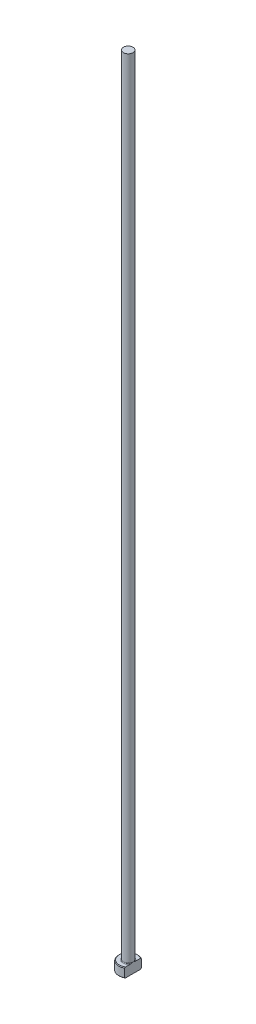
ISO-10303-21;
HEADER;
FILE_DESCRIPTION(('STEP AP214'),'2;1');
FILE_NAME('part.step','',(''),(''),'','','');
FILE_SCHEMA(('AUTOMOTIVE_DESIGN { 1 0 10303 214 1 1 1 1 }'));
ENDSEC;
DATA;
#1=APPLICATION_CONTEXT('core data for automotive mechanical design processes');
#2=APPLICATION_PROTOCOL_DEFINITION('international standard','automotive_design',2000,#1);
#3=PRODUCT_CONTEXT('',#1,'mechanical');
#4=PRODUCT('Part','Part','',(#3));
#5=PRODUCT_RELATED_PRODUCT_CATEGORY('part','',(#4));
#6=PRODUCT_DEFINITION_FORMATION('','',#4);
#7=PRODUCT_DEFINITION_CONTEXT('part definition',#1,'design');
#8=PRODUCT_DEFINITION('design','',#6,#7);
#9=PRODUCT_DEFINITION_SHAPE('','',#8);
#10=(LENGTH_UNIT() NAMED_UNIT(*) SI_UNIT(.MILLI.,.METRE.));
#11=(NAMED_UNIT(*) PLANE_ANGLE_UNIT() SI_UNIT($,.RADIAN.));
#12=(NAMED_UNIT(*) SI_UNIT($,.STERADIAN.) SOLID_ANGLE_UNIT());
#13=UNCERTAINTY_MEASURE_WITH_UNIT(LENGTH_MEASURE(1.E-05),#10,'distance_accuracy_value','');
#14=(GEOMETRIC_REPRESENTATION_CONTEXT(3) GLOBAL_UNCERTAINTY_ASSIGNED_CONTEXT((#13)) GLOBAL_UNIT_ASSIGNED_CONTEXT((#10,
#11,#12)) REPRESENTATION_CONTEXT('',''));
#15=CARTESIAN_POINT('',(0.,0.,0.));
#16=DIRECTION('',(0.,0.,1.));
#17=DIRECTION('',(1.,0.,0.));
#18=AXIS2_PLACEMENT_3D('',#15,#16,#17);
#19=CARTESIAN_POINT('',(0.,0.,0.));
#20=DIRECTION('',(0.,-1.,0.));
#21=DIRECTION('',(0.,0.,-1.));
#22=AXIS2_PLACEMENT_3D('',#19,#20,#21);
#23=PLANE('',#22);
#24=CARTESIAN_POINT('',(0.,0.,0.));
#25=DIRECTION('',(0.,-1.,0.));
#26=DIRECTION('',(0.,0.,-1.));
#27=AXIS2_PLACEMENT_3D('',#24,#25,#26);
#28=CIRCLE('',#27,2.8);
#29=CARTESIAN_POINT('',(1.49999999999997,0.,2.36431808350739));
#30=VERTEX_POINT('',#29);
#31=CARTESIAN_POINT('',(1.49999999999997,0.,-2.36431808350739));
#32=VERTEX_POINT('',#31);
#33=EDGE_CURVE('E98',#30,#32,#28,.T.);
#34=ORIENTED_EDGE('',*,*,#33,.T.);
#35=DIRECTION('',(0.,0.,1.));
#36=VECTOR('',#35,1.);
#37=CARTESIAN_POINT('',(1.49999999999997,0.,-2.5980762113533));
#38=LINE('',#37,#36);
#39=EDGE_CURVE('E83',#32,#30,#38,.T.);
#40=ORIENTED_EDGE('',*,*,#39,.T.);
#41=EDGE_LOOP('',(#34,#40));
#42=FACE_BOUND('',#41,.T.);
#43=ADVANCED_FACE('F32',(#42),#23,.T.);
#44=CARTESIAN_POINT('',(0.,259.958771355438,0.));
#45=DIRECTION('',(0.,1.,0.));
#46=DIRECTION('',(0.,0.,1.));
#47=AXIS2_PLACEMENT_3D('',#44,#45,#46);
#48=CYLINDRICAL_SURFACE('',#47,2.99999999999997);
#49=CARTESIAN_POINT('',(0.,2.80000000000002,0.));
#50=DIRECTION('',(0.,1.,0.));
#51=DIRECTION('',(0.,0.,1.));
#52=AXIS2_PLACEMENT_3D('',#49,#50,#51);
#53=CIRCLE('',#52,2.99999999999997);
#54=CARTESIAN_POINT('',(1.49999999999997,2.80000000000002,2.5980762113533));
#55=VERTEX_POINT('',#54);
#56=CARTESIAN_POINT('',(1.49999999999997,2.80000000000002,-2.5980762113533));
#57=VERTEX_POINT('',#56);
#58=EDGE_CURVE('E104',#55,#57,#53,.F.);
#59=ORIENTED_EDGE('',*,*,#58,.T.);
#60=DIRECTION('',(0.,-1.,0.));
#61=VECTOR('',#60,1.);
#62=CARTESIAN_POINT('',(1.49999999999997,250.,-2.5980762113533));
#63=LINE('',#62,#61);
#64=CARTESIAN_POINT('',(1.49999999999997,0.199999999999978,-2.5980762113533));
#65=VERTEX_POINT('',#64);
#66=EDGE_CURVE('E183',#57,#65,#63,.T.);
#67=ORIENTED_EDGE('',*,*,#66,.T.);
#68=CARTESIAN_POINT('',(0.,0.199999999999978,0.));
#69=DIRECTION('',(0.,-1.,0.));
#70=DIRECTION('',(0.,0.,-1.));
#71=AXIS2_PLACEMENT_3D('',#68,#69,#70);
#72=CIRCLE('',#71,2.99999999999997);
#73=CARTESIAN_POINT('',(1.49999999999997,0.199999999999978,2.5980762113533));
#74=VERTEX_POINT('',#73);
#75=EDGE_CURVE('E100',#65,#74,#72,.F.);
#76=ORIENTED_EDGE('',*,*,#75,.T.);
#77=DIRECTION('',(0.,-1.,0.));
#78=VECTOR('',#77,1.);
#79=CARTESIAN_POINT('',(1.49999999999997,250.,2.5980762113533));
#80=LINE('',#79,#78);
#81=EDGE_CURVE('E93',#55,#74,#80,.T.);
#82=ORIENTED_EDGE('',*,*,#81,.F.);
#83=EDGE_LOOP('',(#59,#67,#76,#82));
#84=FACE_BOUND('',#83,.T.);
#85=ADVANCED_FACE('F158',(#84),#48,.T.);
#86=CARTESIAN_POINT('',(-2.99999999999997,3.,0.));
#87=DIRECTION('',(0.,1.,0.));
#88=DIRECTION('',(0.,0.,1.));
#89=AXIS2_PLACEMENT_3D('',#86,#87,#88);
#90=PLANE('',#89);
#91=CARTESIAN_POINT('',(0.,3.,0.));
#92=DIRECTION('',(0.,1.,0.));
#93=DIRECTION('',(0.,0.,1.));
#94=AXIS2_PLACEMENT_3D('',#91,#92,#93);
#95=CIRCLE('',#94,2.80000000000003);
#96=CARTESIAN_POINT('',(1.49999999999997,3.,-2.36431808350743));
#97=VERTEX_POINT('',#96);
#98=CARTESIAN_POINT('',(1.49999999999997,3.,2.36431808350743));
#99=VERTEX_POINT('',#98);
#100=EDGE_CURVE('E178',#97,#99,#95,.T.);
#101=ORIENTED_EDGE('',*,*,#100,.T.);
#102=DIRECTION('',(0.,0.,-1.));
#103=VECTOR('',#102,1.);
#104=CARTESIAN_POINT('',(1.49999999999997,3.,0.));
#105=LINE('',#104,#103);
#106=CARTESIAN_POINT('',(1.49999999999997,2.99999999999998,0.799999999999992));
#107=VERTEX_POINT('',#106);
#108=EDGE_CURVE('E57',#99,#107,#105,.T.);
#109=ORIENTED_EDGE('',*,*,#108,.T.);
#110=CARTESIAN_POINT('',(0.,3.,0.));
#111=DIRECTION('',(0.,1.,0.));
#112=DIRECTION('',(0.,0.,1.));
#113=AXIS2_PLACEMENT_3D('',#110,#111,#112);
#114=CIRCLE('',#113,1.69999999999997);
#115=CARTESIAN_POINT('',(1.49999999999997,2.99999999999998,-0.799999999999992));
#116=VERTEX_POINT('',#115);
#117=EDGE_CURVE('E107',#107,#116,#114,.F.);
#118=ORIENTED_EDGE('',*,*,#117,.T.);
#119=EDGE_CURVE('E136',#116,#97,#105,.T.);
#120=ORIENTED_EDGE('',*,*,#119,.T.);
#121=EDGE_LOOP('',(#101,#109,#118,#120));
#122=FACE_BOUND('',#121,.T.);
#123=ADVANCED_FACE('F147',(#122),#90,.T.);
#124=CARTESIAN_POINT('',(0.,3.,0.));
#125=DIRECTION('',(0.,-1.,0.));
#126=DIRECTION('',(0.,0.,-1.));
#127=AXIS2_PLACEMENT_3D('',#124,#125,#126);
#128=CONICAL_SURFACE('',#127,2.80000000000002,0.785398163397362);
#129=ORIENTED_EDGE('',*,*,#58,.F.);
#130=CARTESIAN_POINT('',(1.49999999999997,-0.111741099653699,5.71827621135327));
#131=CARTESIAN_POINT('',(1.49999999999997,0.013618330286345,5.58866816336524));
#132=CARTESIAN_POINT('',(1.49999999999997,0.138843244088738,5.45892957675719));
#133=CARTESIAN_POINT('',(1.49999999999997,0.388944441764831,5.19911365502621));
#134=CARTESIAN_POINT('',(1.49999999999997,0.513820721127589,5.06903631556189));
#135=CARTESIAN_POINT('',(1.49999999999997,0.763205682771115,4.80840180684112));
#136=CARTESIAN_POINT('',(1.49999999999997,0.887714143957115,4.67784442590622));
#137=CARTESIAN_POINT('',(1.49999999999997,1.13618059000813,4.41620813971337));
#138=CARTESIAN_POINT('',(1.49999999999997,1.26013857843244,4.28512923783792));
#139=CARTESIAN_POINT('',(1.49999999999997,1.50488975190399,4.02490837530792));
#140=CARTESIAN_POINT('',(1.49999999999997,1.62569693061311,3.89577958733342));
#141=CARTESIAN_POINT('',(1.49999999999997,1.86640694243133,3.63668213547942));
#142=CARTESIAN_POINT('',(1.49999999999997,1.98630978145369,3.50671347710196));
#143=CARTESIAN_POINT('',(1.49999999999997,2.2248603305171,3.24567921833));
#144=CARTESIAN_POINT('',(1.49999999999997,2.34350830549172,3.11461386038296));
#145=CARTESIAN_POINT('',(1.49999999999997,2.57907716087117,2.85094268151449));
#146=CARTESIAN_POINT('',(1.49999999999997,2.69599811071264,2.71833692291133));
#147=CARTESIAN_POINT('',(1.49999999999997,2.88262371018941,2.50255231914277));
#148=CARTESIAN_POINT('',(1.49999999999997,2.95312454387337,2.42006293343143));
#149=CARTESIAN_POINT('',(1.49999999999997,3.0928709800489,2.25401084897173));
#150=CARTESIAN_POINT('',(1.49999999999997,3.16211645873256,2.17044804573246));
#151=CARTESIAN_POINT('',(1.49999999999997,3.29964684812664,2.00105967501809));
#152=CARTESIAN_POINT('',(1.49999999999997,3.36791386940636,1.91521952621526));
#153=CARTESIAN_POINT('',(1.49999999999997,3.50205840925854,1.74171392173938));
#154=CARTESIAN_POINT('',(1.49999999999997,3.56793649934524,1.65404891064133));
#155=CARTESIAN_POINT('',(1.49999999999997,3.69728151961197,1.47490236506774));
#156=CARTESIAN_POINT('',(1.49999999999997,3.76069661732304,1.3833830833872));
#157=CARTESIAN_POINT('',(1.49999999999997,3.88239539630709,1.19675661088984));
#158=CARTESIAN_POINT('',(1.49999999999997,3.94067201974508,1.10164473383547));
#159=CARTESIAN_POINT('',(1.49999999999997,4.04841325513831,0.908008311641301));
#160=CARTESIAN_POINT('',(1.49999999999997,4.09797809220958,0.809540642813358));
#161=CARTESIAN_POINT('',(1.49999999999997,4.18432188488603,0.607192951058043));
#162=CARTESIAN_POINT('',(1.49999999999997,4.22114374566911,0.50333247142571));
#163=CARTESIAN_POINT('',(1.49999999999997,4.26099935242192,0.347577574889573));
#164=CARTESIAN_POINT('',(1.49999999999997,4.27157029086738,0.297609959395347));
#165=CARTESIAN_POINT('',(1.49999999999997,4.28794860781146,0.196885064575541));
#166=CARTESIAN_POINT('',(1.49999999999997,4.29375640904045,0.1461278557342));
#167=CARTESIAN_POINT('',(1.49999999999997,4.30019707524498,0.0444388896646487));
#168=CARTESIAN_POINT('',(1.49999999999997,4.30084594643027,-0.0064918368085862));
#169=CARTESIAN_POINT('',(1.49999999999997,4.29696416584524,-0.108155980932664));
#170=CARTESIAN_POINT('',(1.49999999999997,4.29243308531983,-0.158889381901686));
#171=CARTESIAN_POINT('',(1.49999999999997,4.27856915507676,-0.259234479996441));
#172=CARTESIAN_POINT('',(1.49999999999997,4.26927821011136,-0.308852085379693));
#173=CARTESIAN_POINT('',(1.49999999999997,4.24647108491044,-0.407110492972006));
#174=CARTESIAN_POINT('',(1.49999999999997,4.23295324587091,-0.455750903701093));
#175=CARTESIAN_POINT('',(1.49999999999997,4.20226175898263,-0.552149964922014));
#176=CARTESIAN_POINT('',(1.49999999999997,4.18506801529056,-0.599902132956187));
#177=CARTESIAN_POINT('',(1.49999999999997,4.14771387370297,-0.694205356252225));
#178=CARTESIAN_POINT('',(1.49999999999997,4.12755408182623,-0.74075665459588));
#179=CARTESIAN_POINT('',(1.49999999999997,4.06327696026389,-0.879166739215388));
#180=CARTESIAN_POINT('',(1.49999999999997,4.01551721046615,-0.969329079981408));
#181=CARTESIAN_POINT('',(1.49999999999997,3.91367909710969,-1.14604316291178));
#182=CARTESIAN_POINT('',(1.49999999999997,3.85959300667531,-1.23259031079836));
#183=CARTESIAN_POINT('',(1.49999999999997,3.74697968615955,-1.40321348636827));
#184=CARTESIAN_POINT('',(1.49999999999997,3.68843573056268,-1.48727838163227));
#185=CARTESIAN_POINT('',(1.49999999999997,3.56843845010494,-1.65322187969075));
#186=CARTESIAN_POINT('',(1.49999999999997,3.50698656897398,-1.73510153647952));
#187=CARTESIAN_POINT('',(1.49999999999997,3.3811567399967,-1.89829823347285));
#188=CARTESIAN_POINT('',(1.49999999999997,3.31675092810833,-1.97959369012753));
#189=CARTESIAN_POINT('',(1.49999999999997,3.18634068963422,-2.14090082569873));
#190=CARTESIAN_POINT('',(1.49999999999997,3.12033609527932,-2.22091236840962));
#191=CARTESIAN_POINT('',(1.49999999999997,2.92086431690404,-2.4590650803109));
#192=CARTESIAN_POINT('',(1.49999999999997,2.78562663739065,-2.61572090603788));
#193=CARTESIAN_POINT('',(1.49999999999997,2.53554498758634,-2.90006295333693));
#194=CARTESIAN_POINT('',(1.49999999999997,2.42114543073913,-3.0281438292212));
#195=CARTESIAN_POINT('',(1.49999999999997,2.19093557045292,-3.28303767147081));
#196=CARTESIAN_POINT('',(1.49999999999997,2.07512522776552,-3.40985060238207));
#197=CARTESIAN_POINT('',(1.49999999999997,1.72597067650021,-3.7891384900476));
#198=CARTESIAN_POINT('',(1.49999999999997,1.49111760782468,-4.04022177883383));
#199=CARTESIAN_POINT('',(1.49999999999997,1.02882478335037,-4.52992803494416));
#200=CARTESIAN_POINT('',(1.49999999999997,0.801477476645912,-4.76863870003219));
#201=CARTESIAN_POINT('',(1.49999999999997,0.459548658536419,-5.12558036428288));
#202=CARTESIAN_POINT('',(1.49999999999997,0.345484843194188,-5.24430773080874));
#203=CARTESIAN_POINT('',(1.49999999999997,0.117071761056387,-5.48148573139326));
#204=CARTESIAN_POINT('',(1.49999999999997,0.00272249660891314,-5.59993636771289));
#205=CARTESIAN_POINT('',(1.49999999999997,-0.111741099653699,-5.71827621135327));
#206=B_SPLINE_CURVE_WITH_KNOTS('',3,(#130,#131,#132,#133,#134,#135,#136,#137,#138,#139,#140,
#141,#142,#143,#144,#145,#146,#147,#148,#149,#150,#151,#152,#153,#154,#155,#156,#157,#158,#159,
#160,#161,#162,#163,#164,#165,#166,#167,#168,#169,#170,#171,#172,#173,#174,#175,#176,#177,#178,
#179,#180,#181,#182,#183,#184,#185,#186,#187,#188,#189,#190,#191,#192,#193,#194,#195,#196,#197,
#198,#199,#200,#201,#202,#203,#204,#205),.UNSPECIFIED.,.F.,.F.,(4,2,2,2,2,2,2,2,2,2,2,2,2,2,2,2,
2,2,2,2,2,2,2,2,2,2,2,2,2,2,2,2,2,2,2,2,2,4),(0.,0.540943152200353,1.08189327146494,
1.62312052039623,2.16434426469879,2.69482920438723,3.22531067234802,3.75567781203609,
4.28602356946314,4.61155053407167,4.93710943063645,5.26610945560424,5.59503024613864,
5.92894782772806,6.26331713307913,6.59354403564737,6.92264800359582,7.07567478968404,
7.22868799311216,7.38122626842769,7.53377717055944,7.68500755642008,7.83629736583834,
7.98843643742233,8.14054446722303,8.44618799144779,8.75220879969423,9.05944044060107,
9.3665211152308,9.67764287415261,9.98879742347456,10.6095925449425,11.1247803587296,
11.6399825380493,12.6713544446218,13.6603005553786,14.1542238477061,14.6481430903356),.UNSPECIFIED.);
#207=EDGE_CURVE('E135',#55,#99,#206,.T.);
#208=ORIENTED_EDGE('',*,*,#207,.T.);
#209=ORIENTED_EDGE('',*,*,#100,.F.);
#210=EDGE_CURVE('E127',#97,#57,#206,.T.);
#211=ORIENTED_EDGE('',*,*,#210,.T.);
#212=EDGE_LOOP('',(#129,#208,#209,#211));
#213=FACE_BOUND('',#212,.T.);
#214=ADVANCED_FACE('F143',(#213),#128,.T.);
#215=CARTESIAN_POINT('',(0.,0.199999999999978,0.));
#216=DIRECTION('',(0.,1.,0.));
#217=DIRECTION('',(0.,0.,1.));
#218=AXIS2_PLACEMENT_3D('',#215,#216,#217);
#219=CONICAL_SURFACE('',#218,2.99999999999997,0.785398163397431);
#220=ORIENTED_EDGE('',*,*,#75,.F.);
#221=CARTESIAN_POINT('',(1.49999999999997,3.1117410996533,-5.71827621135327));
#222=CARTESIAN_POINT('',(1.49999999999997,2.98638166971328,-5.58866816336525));
#223=CARTESIAN_POINT('',(1.49999999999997,2.86115675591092,-5.45892957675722));
#224=CARTESIAN_POINT('',(1.49999999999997,2.61105555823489,-5.19911365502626));
#225=CARTESIAN_POINT('',(1.49999999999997,2.48617927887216,-5.06903631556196));
#226=CARTESIAN_POINT('',(1.49999999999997,2.23679431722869,-4.80840180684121));
#227=CARTESIAN_POINT('',(1.49999999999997,2.11228585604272,-4.67784442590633));
#228=CARTESIAN_POINT('',(1.49999999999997,1.86381940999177,-4.4162081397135));
#229=CARTESIAN_POINT('',(1.49999999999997,1.73986142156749,-4.28512923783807));
#230=CARTESIAN_POINT('',(1.49999999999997,1.49511024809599,-4.02490837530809));
#231=CARTESIAN_POINT('',(1.49999999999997,1.3743030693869,-3.8957795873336));
#232=CARTESIAN_POINT('',(1.49999999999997,1.13359305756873,-3.63668213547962));
#233=CARTESIAN_POINT('',(1.49999999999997,1.0136902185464,-3.50671347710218));
#234=CARTESIAN_POINT('',(1.49999999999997,0.775139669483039,-3.24567921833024));
#235=CARTESIAN_POINT('',(1.49999999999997,0.656491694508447,-3.11461386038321));
#236=CARTESIAN_POINT('',(1.49999999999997,0.420922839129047,-2.85094268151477));
#237=CARTESIAN_POINT('',(1.49999999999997,0.304001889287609,-2.71833692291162));
#238=CARTESIAN_POINT('',(1.49999999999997,0.117376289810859,-2.50255231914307));
#239=CARTESIAN_POINT('',(1.49999999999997,0.0468754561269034,-2.42006293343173));
#240=CARTESIAN_POINT('',(1.49999999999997,-0.0928709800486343,-2.254010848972));
#241=CARTESIAN_POINT('',(1.49999999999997,-0.162116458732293,-2.17044804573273));
#242=CARTESIAN_POINT('',(1.49999999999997,-0.299646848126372,-2.00105967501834));
#243=CARTESIAN_POINT('',(1.49999999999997,-0.367913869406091,-1.9152195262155));
#244=CARTESIAN_POINT('',(1.49999999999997,-0.502058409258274,-1.7417139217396));
#245=CARTESIAN_POINT('',(1.49999999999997,-0.567936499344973,-1.65404891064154));
#246=CARTESIAN_POINT('',(1.49999999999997,-0.697281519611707,-1.47490236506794));
#247=CARTESIAN_POINT('',(1.49999999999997,-0.760696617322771,-1.38338308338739));
#248=CARTESIAN_POINT('',(1.49999999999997,-0.882395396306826,-1.19675661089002));
#249=CARTESIAN_POINT('',(1.49999999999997,-0.940672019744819,-1.10164473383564));
#250=CARTESIAN_POINT('',(1.49999999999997,-1.04841325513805,-0.908008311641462));
#251=CARTESIAN_POINT('',(1.49999999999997,-1.09797809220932,-0.809540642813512));
#252=CARTESIAN_POINT('',(1.49999999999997,-1.18432188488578,-0.607192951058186));
#253=CARTESIAN_POINT('',(1.49999999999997,-1.22114374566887,-0.503332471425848));
#254=CARTESIAN_POINT('',(1.49999999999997,-1.26099935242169,-0.347577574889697));
#255=CARTESIAN_POINT('',(1.49999999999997,-1.27157029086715,-0.297609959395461));
#256=CARTESIAN_POINT('',(1.49999999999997,-1.28794860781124,-0.196885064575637));
#257=CARTESIAN_POINT('',(1.49999999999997,-1.29375640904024,-0.146127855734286));
#258=CARTESIAN_POINT('',(1.49999999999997,-1.30019707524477,-0.0444388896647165));
#259=CARTESIAN_POINT('',(1.49999999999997,-1.30084594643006,0.00649183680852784));
#260=CARTESIAN_POINT('',(1.49999999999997,-1.29696416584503,0.108155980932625));
#261=CARTESIAN_POINT('',(1.49999999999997,-1.29243308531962,0.158889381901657));
#262=CARTESIAN_POINT('',(1.49999999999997,-1.27856915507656,0.259234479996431));
#263=CARTESIAN_POINT('',(1.49999999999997,-1.26927821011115,0.308852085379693));
#264=CARTESIAN_POINT('',(1.49999999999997,-1.24647108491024,0.407110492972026));
#265=CARTESIAN_POINT('',(1.49999999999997,-1.2329532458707,0.455750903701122));
#266=CARTESIAN_POINT('',(1.49999999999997,-1.20226175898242,0.552149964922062));
#267=CARTESIAN_POINT('',(1.49999999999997,-1.18506801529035,0.599902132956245));
#268=CARTESIAN_POINT('',(1.49999999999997,-1.14771387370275,0.694205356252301));
#269=CARTESIAN_POINT('',(1.49999999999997,-1.12755408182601,0.740756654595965));
#270=CARTESIAN_POINT('',(1.49999999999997,-1.06327696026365,0.879166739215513));
#271=CARTESIAN_POINT('',(1.49999999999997,-1.0155172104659,0.969329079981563));
#272=CARTESIAN_POINT('',(1.49999999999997,-0.913679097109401,1.14604316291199));
#273=CARTESIAN_POINT('',(1.49999999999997,-0.859593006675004,1.2325903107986));
#274=CARTESIAN_POINT('',(1.49999999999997,-0.746979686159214,1.40321348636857));
#275=CARTESIAN_POINT('',(1.49999999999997,-0.688435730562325,1.4872783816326));
#276=CARTESIAN_POINT('',(1.49999999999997,-0.568438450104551,1.65322187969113));
#277=CARTESIAN_POINT('',(1.49999999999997,-0.506986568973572,1.73510153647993));
#278=CARTESIAN_POINT('',(1.49999999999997,-0.381156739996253,1.89829823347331));
#279=CARTESIAN_POINT('',(1.49999999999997,-0.31675092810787,1.97959369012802));
#280=CARTESIAN_POINT('',(1.49999999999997,-0.186340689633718,2.14090082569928));
#281=CARTESIAN_POINT('',(1.49999999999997,-0.120336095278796,2.22091236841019));
#282=CARTESIAN_POINT('',(1.49999999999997,0.0791356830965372,2.45906508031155));
#283=CARTESIAN_POINT('',(1.49999999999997,0.214373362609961,2.61572090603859));
#284=CARTESIAN_POINT('',(1.49999999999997,0.464455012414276,2.90006295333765));
#285=CARTESIAN_POINT('',(1.49999999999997,0.578854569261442,3.02814382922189));
#286=CARTESIAN_POINT('',(1.49999999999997,0.809064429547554,3.28303767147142));
#287=CARTESIAN_POINT('',(1.49999999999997,0.924874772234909,3.40985060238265));
#288=CARTESIAN_POINT('',(1.49999999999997,1.27402932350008,3.78913849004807));
#289=CARTESIAN_POINT('',(1.49999999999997,1.50888239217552,4.04022177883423));
#290=CARTESIAN_POINT('',(1.49999999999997,1.97117521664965,4.52992803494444));
#291=CARTESIAN_POINT('',(1.49999999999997,2.19852252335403,4.76863870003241));
#292=CARTESIAN_POINT('',(1.49999999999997,2.54045134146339,5.12558036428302));
#293=CARTESIAN_POINT('',(1.49999999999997,2.65451515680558,5.24430773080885));
#294=CARTESIAN_POINT('',(1.49999999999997,2.8829282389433,5.48148573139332));
#295=CARTESIAN_POINT('',(1.49999999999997,2.99727750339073,5.59993636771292));
#296=CARTESIAN_POINT('',(1.49999999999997,3.1117410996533,5.71827621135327));
#297=B_SPLINE_CURVE_WITH_KNOTS('',3,(#221,#222,#223,#224,#225,#226,#227,#228,#229,#230,#231,
#232,#233,#234,#235,#236,#237,#238,#239,#240,#241,#242,#243,#244,#245,#246,#247,#248,#249,#250,
#251,#252,#253,#254,#255,#256,#257,#258,#259,#260,#261,#262,#263,#264,#265,#266,#267,#268,#269,
#270,#271,#272,#273,#274,#275,#276,#277,#278,#279,#280,#281,#282,#283,#284,#285,#286,#287,#288,
#289,#290,#291,#292,#293,#294,#295,#296),.UNSPECIFIED.,.F.,.F.,(4,2,2,2,2,2,2,2,2,2,2,2,2,2,2,2,
2,2,2,2,2,2,2,2,2,2,2,2,2,2,2,2,2,2,2,2,2,4),(0.,0.540943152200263,1.08189327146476,
1.62312052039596,2.16434426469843,2.69482920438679,3.22531067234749,3.75567781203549,
4.28602356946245,4.611550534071,4.9371094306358,5.26610945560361,5.59503024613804,
5.92894782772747,6.26331713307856,6.59354403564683,6.92264800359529,7.07567478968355,
7.2286879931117,7.38122626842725,7.53377717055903,7.6850075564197,7.83629736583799,
7.98843643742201,8.14054446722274,8.4461879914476,8.75220879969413,9.05944044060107,
9.3665211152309,9.67764287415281,9.98879742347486,10.609592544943,11.1247803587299,
11.6399825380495,12.6713544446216,13.6603005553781,14.1542238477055,14.6481430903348),.UNSPECIFIED.);
#298=EDGE_CURVE('E86',#65,#32,#297,.T.);
#299=ORIENTED_EDGE('',*,*,#298,.T.);
#300=ORIENTED_EDGE('',*,*,#33,.F.);
#301=EDGE_CURVE('E89',#30,#74,#297,.T.);
#302=ORIENTED_EDGE('',*,*,#301,.T.);
#303=EDGE_LOOP('',(#220,#299,#300,#302));
#304=FACE_BOUND('',#303,.T.);
#305=ADVANCED_FACE('F97',(#304),#219,.T.);
#306=CARTESIAN_POINT('',(0.,3.19999999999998,0.));
#307=DIRECTION('',(0.,1.,0.));
#308=DIRECTION('',(0.,0.,1.));
#309=AXIS2_PLACEMENT_3D('',#306,#307,#308);
#310=TOROIDAL_SURFACE('',#309,1.69999999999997,0.2);
#311=CARTESIAN_POINT('',(1.49999999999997,3.19999999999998,0.));
#312=CARTESIAN_POINT('',(1.49999999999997,3.20000050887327,7.14686524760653E-11));
#313=CARTESIAN_POINT('',(1.49999999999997,3.20000101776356,-1.21663671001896E-07));
#314=CARTESIAN_POINT('',(1.49999999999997,3.20000199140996,-4.97616231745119E-07));
#315=CARTESIAN_POINT('',(1.49999999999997,3.20000245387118,-7.56516213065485E-07));
#316=CARTESIAN_POINT('',(1.49999999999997,3.20000338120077,-1.37642836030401E-06));
#317=CARTESIAN_POINT('',(1.49999999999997,3.20000384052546,-1.74563475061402E-06));
#318=CARTESIAN_POINT('',(1.49999999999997,3.20000469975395,-2.53565983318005E-06));
#319=CARTESIAN_POINT('',(1.49999999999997,3.20000510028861,-2.95582595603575E-06));
#320=CARTESIAN_POINT('',(1.49999999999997,3.20000646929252,-4.48430443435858E-06));
#321=CARTESIAN_POINT('',(1.49999999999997,3.20000736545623,-5.6586103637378E-06));
#322=CARTESIAN_POINT('',(1.49999999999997,3.20000893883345,-8.06479198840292E-06));
#323=CARTESIAN_POINT('',(1.49999999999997,3.20000962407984,-9.29170513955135E-06));
#324=CARTESIAN_POINT('',(1.49999999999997,3.2000122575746,-1.41623288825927E-05));
#325=CARTESIAN_POINT('',(1.49999999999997,3.20001407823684,-1.78790031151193E-05));
#326=CARTESIAN_POINT('',(1.49999999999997,3.20001699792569,-2.51443065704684E-05));
#327=CARTESIAN_POINT('',(1.49999999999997,3.20001815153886,-2.86715393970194E-05));
#328=CARTESIAN_POINT('',(1.49999999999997,3.20002315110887,-4.39218127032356E-05));
#329=CARTESIAN_POINT('',(1.49999999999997,3.2000270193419,-5.56288388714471E-05));
#330=CARTESIAN_POINT('',(1.49999999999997,3.20003312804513,-7.74058287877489E-05));
#331=CARTESIAN_POINT('',(1.49999999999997,3.20003553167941,-8.7427840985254E-05));
#332=CARTESIAN_POINT('',(1.49999999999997,3.20005483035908,-0.00016122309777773));
#333=CARTESIAN_POINT('',(1.49999999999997,3.2000797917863,-0.000222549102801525));
#334=CARTESIAN_POINT('',(1.49999999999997,3.20017391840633,-0.000462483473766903));
#335=CARTESIAN_POINT('',(1.49999999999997,3.20023706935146,-0.000642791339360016));
#336=CARTESIAN_POINT('',(1.49999999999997,3.20048761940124,-0.00134785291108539));
#337=CARTESIAN_POINT('',(1.49999999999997,3.20068132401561,-0.00187087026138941));
#338=CARTESIAN_POINT('',(1.49999999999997,3.20147357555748,-0.0040200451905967));
#339=CARTESIAN_POINT('',(1.49999999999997,3.20206499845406,-0.00564811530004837));
#340=CARTESIAN_POINT('',(1.49999999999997,3.2089263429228,-0.0245232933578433));
#341=CARTESIAN_POINT('',(1.49999999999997,3.21523683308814,-0.0417598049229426));
#342=CARTESIAN_POINT('',(1.49999999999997,3.22755028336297,-0.0756091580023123));
#343=CARTESIAN_POINT('',(1.49999999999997,3.23355589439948,-0.0922211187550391));
#344=CARTESIAN_POINT('',(1.49999999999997,3.2462010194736,-0.127454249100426));
#345=CARTESIAN_POINT('',(1.49999999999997,3.25283080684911,-0.146078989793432));
#346=CARTESIAN_POINT('',(1.49999999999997,3.26599765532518,-0.183577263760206));
#347=CARTESIAN_POINT('',(1.49999999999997,3.2725330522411,-0.202451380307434));
#348=CARTESIAN_POINT('',(1.49999999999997,3.28834228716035,-0.248982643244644));
#349=CARTESIAN_POINT('',(1.49999999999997,3.29749152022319,-0.276682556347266));
#350=CARTESIAN_POINT('',(1.49999999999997,3.3149093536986,-0.331625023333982));
#351=CARTESIAN_POINT('',(1.49999999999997,3.32319386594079,-0.358862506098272));
#352=CARTESIAN_POINT('',(1.49999999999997,3.34051594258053,-0.419125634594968));
#353=CARTESIAN_POINT('',(1.49999999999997,3.34936607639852,-0.452206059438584));
#354=CARTESIAN_POINT('',(1.49999999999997,3.36549583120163,-0.519023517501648));
#355=CARTESIAN_POINT('',(1.49999999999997,3.37276283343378,-0.552763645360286));
#356=CARTESIAN_POINT('',(1.49999999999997,3.38554755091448,-0.623053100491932));
#357=CARTESIAN_POINT('',(1.49999999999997,3.39090573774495,-0.659632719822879));
#358=CARTESIAN_POINT('',(1.49999999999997,3.39825016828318,-0.733028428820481));
#359=CARTESIAN_POINT('',(1.49999999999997,3.40024734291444,-0.769843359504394));
#360=CARTESIAN_POINT('',(1.49999999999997,3.39970780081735,-0.842856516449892));
#361=CARTESIAN_POINT('',(1.49999999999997,3.39725347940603,-0.87905368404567));
#362=CARTESIAN_POINT('',(1.49999999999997,3.38900085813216,-0.932380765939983));
#363=CARTESIAN_POINT('',(1.49999999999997,3.38553049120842,-0.949868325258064));
#364=CARTESIAN_POINT('',(1.49999999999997,3.37678336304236,-0.98437493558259));
#365=CARTESIAN_POINT('',(1.49999999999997,3.37150943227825,-1.00139467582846));
#366=CARTESIAN_POINT('',(1.49999999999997,3.35869781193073,-1.03479423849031));
#367=CARTESIAN_POINT('',(1.49999999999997,3.3511359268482,-1.05116499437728));
#368=CARTESIAN_POINT('',(1.49999999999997,3.33325333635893,-1.08234828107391));
#369=CARTESIAN_POINT('',(1.49999999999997,3.32294266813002,-1.097166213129));
#370=CARTESIAN_POINT('',(1.49999999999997,3.30512758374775,-1.11714173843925));
#371=CARTESIAN_POINT('',(1.49999999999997,3.29884721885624,-1.1233906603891));
#372=CARTESIAN_POINT('',(1.49999999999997,3.28545950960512,-1.13494695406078));
#373=CARTESIAN_POINT('',(1.49999999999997,3.27835226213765,-1.14025443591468));
#374=CARTESIAN_POINT('',(1.49999999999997,3.26325970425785,-1.14967631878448));
#375=CARTESIAN_POINT('',(1.49999999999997,3.25526534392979,-1.1537764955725));
#376=CARTESIAN_POINT('',(1.49999999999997,3.23863207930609,-1.16034952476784));
#377=CARTESIAN_POINT('',(1.49999999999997,3.22999427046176,-1.16282507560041));
#378=CARTESIAN_POINT('',(1.49999999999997,3.21343922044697,-1.16570267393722));
#379=CARTESIAN_POINT('',(1.49999999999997,3.20555896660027,-1.16631687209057));
#380=CARTESIAN_POINT('',(1.49999999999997,3.18982775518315,-1.16602054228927));
#381=CARTESIAN_POINT('',(1.49999999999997,3.18197679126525,-1.16511036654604));
#382=CARTESIAN_POINT('',(1.49999999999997,3.16747846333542,-1.16204446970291));
#383=CARTESIAN_POINT('',(1.49999999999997,3.16079696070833,-1.16004509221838));
#384=CARTESIAN_POINT('',(1.49999999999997,3.14781700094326,-1.15505972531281));
#385=CARTESIAN_POINT('',(1.49999999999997,3.14151862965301,-1.1520735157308));
#386=CARTESIAN_POINT('',(1.49999999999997,3.12690214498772,-1.14387585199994));
#387=CARTESIAN_POINT('',(1.49999999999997,3.11881436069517,-1.13825400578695));
#388=CARTESIAN_POINT('',(1.49999999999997,3.1036444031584,-1.12578441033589));
#389=CARTESIAN_POINT('',(1.49999999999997,3.09656475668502,-1.11893367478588));
#390=CARTESIAN_POINT('',(1.49999999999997,3.08012297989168,-1.10074342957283));
#391=CARTESIAN_POINT('',(1.49999999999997,3.07136543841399,-1.08886044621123));
#392=CARTESIAN_POINT('',(1.49999999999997,3.05578194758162,-1.06392743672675));
#393=CARTESIAN_POINT('',(1.49999999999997,3.0489571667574,-1.05087671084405));
#394=CARTESIAN_POINT('',(1.49999999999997,3.03273856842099,-1.0147230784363));
#395=CARTESIAN_POINT('',(1.49999999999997,3.02486230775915,-0.990945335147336));
#396=CARTESIAN_POINT('',(1.49999999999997,3.01257693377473,-0.942321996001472));
#397=CARTESIAN_POINT('',(1.49999999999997,3.00820590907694,-0.917467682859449));
#398=CARTESIAN_POINT('',(1.49999999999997,3.00229956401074,-0.867912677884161));
#399=CARTESIAN_POINT('',(1.49999999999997,3.0007128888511,-0.843217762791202));
#400=CARTESIAN_POINT('',(1.49999999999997,2.9996723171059,-0.793746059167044));
#401=CARTESIAN_POINT('',(1.49999999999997,3.0002230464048,-0.768969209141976));
#402=CARTESIAN_POINT('',(1.49999999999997,3.00433101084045,-0.696994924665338));
#403=CARTESIAN_POINT('',(1.49999999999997,3.01016976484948,-0.649931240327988));
#404=CARTESIAN_POINT('',(1.49999999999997,3.02567776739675,-0.559166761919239));
#405=CARTESIAN_POINT('',(1.49999999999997,3.03511950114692,-0.515423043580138));
#406=CARTESIAN_POINT('',(1.49999999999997,3.05693059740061,-0.427590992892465));
#407=CARTESIAN_POINT('',(1.49999999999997,3.0693635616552,-0.383518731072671));
#408=CARTESIAN_POINT('',(1.49999999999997,3.0917495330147,-0.310161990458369));
#409=CARTESIAN_POINT('',(1.49999999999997,3.1011984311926,-0.280718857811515));
#410=CARTESIAN_POINT('',(1.49999999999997,3.12060442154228,-0.22234098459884));
#411=CARTESIAN_POINT('',(1.49999999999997,3.13055519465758,-0.193404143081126));
#412=CARTESIAN_POINT('',(1.49999999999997,3.14973721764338,-0.1387568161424));
#413=CARTESIAN_POINT('',(1.49999999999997,3.15893123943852,-0.113033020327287));
#414=CARTESIAN_POINT('',(1.49999999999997,3.17788037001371,-0.0606351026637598));
#415=CARTESIAN_POINT('',(1.49999999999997,3.18764328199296,-0.0339636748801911));
#416=CARTESIAN_POINT('',(1.49999999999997,3.19793548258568,-0.00564657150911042));
#417=CARTESIAN_POINT('',(1.49999999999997,3.19852751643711,-0.00401699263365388));
#418=CARTESIAN_POINT('',(1.49999999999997,3.1993199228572,-0.00186745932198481));
#419=CARTESIAN_POINT('',(1.49999999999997,3.1995131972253,-0.00134559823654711));
#420=CARTESIAN_POINT('',(1.49999999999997,3.19976322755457,-0.000641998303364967));
#421=CARTESIAN_POINT('',(1.49999999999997,3.19982627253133,-0.000461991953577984));
#422=CARTESIAN_POINT('',(1.49999999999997,3.19992025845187,-0.000222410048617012));
#423=CARTESIAN_POINT('',(1.49999999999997,3.19994519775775,-0.000161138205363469));
#424=CARTESIAN_POINT('',(1.49999999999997,3.1999644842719,-8.74039265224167E-05));
#425=CARTESIAN_POINT('',(1.49999999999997,3.19996688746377,-7.73857554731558E-05));
#426=CARTESIAN_POINT('',(1.49999999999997,3.19997299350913,-5.56173270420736E-05));
#427=CARTESIAN_POINT('',(1.49999999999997,3.19997685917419,-4.39149185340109E-05));
#428=CARTESIAN_POINT('',(1.49999999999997,3.19998185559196,-2.86698156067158E-05));
#429=CARTESIAN_POINT('',(1.49999999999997,3.19998300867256,-2.51431574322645E-05));
#430=CARTESIAN_POINT('',(1.49999999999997,3.19998592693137,-1.78789551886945E-05));
#431=CARTESIAN_POINT('',(1.49999999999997,3.19998774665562,-1.41627846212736E-05));
#432=CARTESIAN_POINT('',(1.49999999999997,3.1999903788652,-9.29264485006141E-06));
#433=CARTESIAN_POINT('',(1.49999999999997,3.19999106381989,-8.06577596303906E-06));
#434=CARTESIAN_POINT('',(1.49999999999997,3.19999263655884,-5.65962636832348E-06));
#435=CARTESIAN_POINT('',(1.49999999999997,3.19999353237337,-4.48530463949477E-06));
#436=CARTESIAN_POINT('',(1.49999999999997,3.19999490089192,-2.95673739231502E-06));
#437=CARTESIAN_POINT('',(1.49999999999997,3.19999530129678,-2.53653206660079E-06));
#438=CARTESIAN_POINT('',(1.49999999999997,3.19999616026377,-1.74640524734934E-06));
#439=CARTESIAN_POINT('',(1.49999999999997,3.19999661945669,-1.37713597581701E-06));
#440=CARTESIAN_POINT('',(1.49999999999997,3.19999754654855,-7.57072329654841E-07));
#441=CARTESIAN_POINT('',(1.49999999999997,3.1999980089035,-4.98087382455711E-07));
#442=CARTESIAN_POINT('',(1.49999999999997,3.19999898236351,-1.21927247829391E-07));
#443=CARTESIAN_POINT('',(1.49999999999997,3.19999949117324,-7.14621145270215E-11));
#444=CARTESIAN_POINT('',(1.49999999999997,3.19999999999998,0.));
#445=B_SPLINE_CURVE_WITH_KNOTS('',3,(#311,#312,#313,#314,#315,#316,#317,#318,#319,#320,#321,
#322,#323,#324,#325,#326,#327,#328,#329,#330,#331,#332,#333,#334,#335,#336,#337,#338,#339,#340,
#341,#342,#343,#344,#345,#346,#347,#348,#349,#350,#351,#352,#353,#354,#355,#356,#357,#358,#359,
#360,#361,#362,#363,#364,#365,#366,#367,#368,#369,#370,#371,#372,#373,#374,#375,#376,#377,#378,
#379,#380,#381,#382,#383,#384,#385,#386,#387,#388,#389,#390,#391,#392,#393,#394,#395,#396,#397,
#398,#399,#400,#401,#402,#403,#404,#405,#406,#407,#408,#409,#410,#411,#412,#413,#414,#415,#416,
#417,#418,#419,#420,#421,#422,#423,#424,#425,#426,#427,#428,#429,#430,#431,#432,#433,#434,#435,
#436,#437,#438,#439,#440,#441,#442,#443,#444),.UNSPECIFIED.,.T.,.F.,(4,2,2,2,2,2,2,2,2,2,2,2,2,
2,2,2,2,2,2,2,2,2,2,2,2,2,2,2,2,2,2,2,2,2,2,2,2,2,2,2,2,2,2,2,2,2,2,2,2,2,2,2,2,2,2,2,2,2,2,2,2,
2,2,2,2,2,4),(0.,1.5268750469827E-06,3.1095939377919E-06,4.8697676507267E-06,
6.6094009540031E-06,1.1020252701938E-05,1.52327800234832E-05,2.76140373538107E-05,
3.87351647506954E-05,7.57188333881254E-05,0.000106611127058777,0.000304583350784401,
0.000878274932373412,0.00255078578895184,0.00774802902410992,0.0628090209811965,
0.115802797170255,0.175110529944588,0.235030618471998,0.322539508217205,0.407938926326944,
0.510638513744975,0.614128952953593,0.724918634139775,0.835347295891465,0.943752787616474,
0.997165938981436,1.05049564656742,1.10441029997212,1.1581307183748,1.18463966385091,
1.21114550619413,1.23795217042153,1.26471419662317,1.28828324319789,1.31184684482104,
1.33268332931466,1.35352446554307,1.38290826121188,1.41236445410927,1.45639976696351,
1.5004616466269,1.5751878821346,1.65071550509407,1.72483484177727,1.79911468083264,
1.94105061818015,2.07520625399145,2.21251544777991,2.30527614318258,2.3970705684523,
2.47902409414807,2.56422207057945,2.56942417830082,2.57109299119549,2.57166572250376,
2.57186352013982,2.57189440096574,2.57193136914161,2.5719424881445,2.5719548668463,
2.57195907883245,2.5719634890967,2.571965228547,2.57196698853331,2.5719685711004,
2.57197009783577),.UNSPECIFIED.);
#446=CARTESIAN_POINT('',(1.49999999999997,3.19999999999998,0.));
#447=VERTEX_POINT('',#446);
#448=EDGE_CURVE('E11',#116,#447,#445,.T.);
#449=ORIENTED_EDGE('',*,*,#448,.F.);
#450=ORIENTED_EDGE('',*,*,#117,.F.);
#451=CARTESIAN_POINT('',(1.49999999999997,3.19999999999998,0.));
#452=CARTESIAN_POINT('',(1.49999999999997,3.19999949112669,-7.14686931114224E-11));
#453=CARTESIAN_POINT('',(1.49999999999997,3.1999989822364,1.21663670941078E-07));
#454=CARTESIAN_POINT('',(1.49999999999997,3.19999800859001,4.97616231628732E-07));
#455=CARTESIAN_POINT('',(1.49999999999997,3.19999754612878,7.56516212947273E-07));
#456=CARTESIAN_POINT('',(1.49999999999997,3.19999661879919,1.37642836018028E-06));
#457=CARTESIAN_POINT('',(1.49999999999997,3.1999961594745,1.74563475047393E-06));
#458=CARTESIAN_POINT('',(1.49999999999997,3.19999530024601,2.53565983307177E-06));
#459=CARTESIAN_POINT('',(1.49999999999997,3.19999489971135,2.95582595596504E-06));
#460=CARTESIAN_POINT('',(1.49999999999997,3.19999353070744,4.48430443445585E-06));
#461=CARTESIAN_POINT('',(1.49999999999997,3.19999263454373,5.65861036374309E-06));
#462=CARTESIAN_POINT('',(1.49999999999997,3.19999106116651,8.06479198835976E-06));
#463=CARTESIAN_POINT('',(1.49999999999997,3.19999037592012,9.29170513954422E-06));
#464=CARTESIAN_POINT('',(1.49999999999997,3.19998774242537,1.41623288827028E-05));
#465=CARTESIAN_POINT('',(1.49999999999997,3.19998592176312,1.78790031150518E-05));
#466=CARTESIAN_POINT('',(1.49999999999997,3.19998300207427,2.51443065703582E-05));
#467=CARTESIAN_POINT('',(1.49999999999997,3.1999818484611,2.86715393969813E-05));
#468=CARTESIAN_POINT('',(1.49999999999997,3.19997684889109,4.39218127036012E-05));
#469=CARTESIAN_POINT('',(1.49999999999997,3.19997298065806,5.56288388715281E-05));
#470=CARTESIAN_POINT('',(1.49999999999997,3.19996687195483,7.7405828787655E-05));
#471=CARTESIAN_POINT('',(1.49999999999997,3.19996446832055,8.74278409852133E-05));
#472=CARTESIAN_POINT('',(1.49999999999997,3.19994516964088,0.000161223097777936));
#473=CARTESIAN_POINT('',(1.49999999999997,3.19992020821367,0.00022254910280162));
#474=CARTESIAN_POINT('',(1.49999999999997,3.19982608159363,0.000462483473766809));
#475=CARTESIAN_POINT('',(1.49999999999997,3.1997629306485,0.000642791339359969));
#476=CARTESIAN_POINT('',(1.49999999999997,3.19951238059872,0.00134785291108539));
#477=CARTESIAN_POINT('',(1.49999999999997,3.19931867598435,0.00187087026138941));
#478=CARTESIAN_POINT('',(1.49999999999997,3.19852642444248,0.0040200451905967));
#479=CARTESIAN_POINT('',(1.49999999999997,3.19793500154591,0.00564811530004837));
#480=CARTESIAN_POINT('',(1.49999999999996,3.19107365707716,0.0245232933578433));
#481=CARTESIAN_POINT('',(1.49999999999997,3.18476316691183,0.0417598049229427));
#482=CARTESIAN_POINT('',(1.49999999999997,3.17244971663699,0.0756091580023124));
#483=CARTESIAN_POINT('',(1.49999999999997,3.16644410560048,0.0922211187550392));
#484=CARTESIAN_POINT('',(1.49999999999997,3.15379898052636,0.127454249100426));
#485=CARTESIAN_POINT('',(1.49999999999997,3.14716919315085,0.146078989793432));
#486=CARTESIAN_POINT('',(1.49999999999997,3.13400234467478,0.183577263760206));
#487=CARTESIAN_POINT('',(1.49999999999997,3.12746694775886,0.202451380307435));
#488=CARTESIAN_POINT('',(1.49999999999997,3.11165771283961,0.248982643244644));
#489=CARTESIAN_POINT('',(1.49999999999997,3.10250847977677,0.276682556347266));
#490=CARTESIAN_POINT('',(1.49999999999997,3.08509064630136,0.331625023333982));
#491=CARTESIAN_POINT('',(1.49999999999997,3.07680613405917,0.358862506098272));
#492=CARTESIAN_POINT('',(1.49999999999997,3.05948405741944,0.419125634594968));
#493=CARTESIAN_POINT('',(1.49999999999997,3.05063392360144,0.452206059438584));
#494=CARTESIAN_POINT('',(1.49999999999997,3.03450416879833,0.519023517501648));
#495=CARTESIAN_POINT('',(1.49999999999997,3.02723716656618,0.552763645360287));
#496=CARTESIAN_POINT('',(1.49999999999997,3.01445244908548,0.623053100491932));
#497=CARTESIAN_POINT('',(1.49999999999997,3.00909426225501,0.659632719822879));
#498=CARTESIAN_POINT('',(1.49999999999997,3.00174983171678,0.733028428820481));
#499=CARTESIAN_POINT('',(1.49999999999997,2.99975265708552,0.769843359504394));
#500=CARTESIAN_POINT('',(1.49999999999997,3.00029219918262,0.842856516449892));
#501=CARTESIAN_POINT('',(1.49999999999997,3.00274652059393,0.87905368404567));
#502=CARTESIAN_POINT('',(1.49999999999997,3.0109991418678,0.932380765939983));
#503=CARTESIAN_POINT('',(1.49999999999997,3.01446950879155,0.949868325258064));
#504=CARTESIAN_POINT('',(1.49999999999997,3.02321663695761,0.98437493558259));
#505=CARTESIAN_POINT('',(1.49999999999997,3.02849056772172,1.00139467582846));
#506=CARTESIAN_POINT('',(1.49999999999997,3.04130218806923,1.03479423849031));
#507=CARTESIAN_POINT('',(1.49999999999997,3.04886407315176,1.05116499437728));
#508=CARTESIAN_POINT('',(1.49999999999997,3.06674666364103,1.08234828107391));
#509=CARTESIAN_POINT('',(1.49999999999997,3.07705733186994,1.097166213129));
#510=CARTESIAN_POINT('',(1.49999999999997,3.09487241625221,1.11714173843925));
#511=CARTESIAN_POINT('',(1.49999999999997,3.10115278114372,1.1233906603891));
#512=CARTESIAN_POINT('',(1.49999999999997,3.11454049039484,1.13494695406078));
#513=CARTESIAN_POINT('',(1.49999999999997,3.12164773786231,1.14025443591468));
#514=CARTESIAN_POINT('',(1.49999999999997,3.13674029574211,1.14967631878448));
#515=CARTESIAN_POINT('',(1.49999999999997,3.14473465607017,1.1537764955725));
#516=CARTESIAN_POINT('',(1.49999999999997,3.16136792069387,1.16034952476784));
#517=CARTESIAN_POINT('',(1.49999999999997,3.1700057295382,1.16282507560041));
#518=CARTESIAN_POINT('',(1.49999999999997,3.18656077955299,1.16570267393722));
#519=CARTESIAN_POINT('',(1.49999999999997,3.19444103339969,1.16631687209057));
#520=CARTESIAN_POINT('',(1.49999999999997,3.21017224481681,1.16602054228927));
#521=CARTESIAN_POINT('',(1.49999999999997,3.21802320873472,1.16511036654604));
#522=CARTESIAN_POINT('',(1.49999999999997,3.23252153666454,1.16204446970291));
#523=CARTESIAN_POINT('',(1.49999999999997,3.23920303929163,1.16004509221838));
#524=CARTESIAN_POINT('',(1.49999999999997,3.2521829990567,1.15505972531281));
#525=CARTESIAN_POINT('',(1.49999999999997,3.25848137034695,1.1520735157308));
#526=CARTESIAN_POINT('',(1.49999999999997,3.27309785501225,1.14387585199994));
#527=CARTESIAN_POINT('',(1.49999999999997,3.28118563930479,1.13825400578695));
#528=CARTESIAN_POINT('',(1.49999999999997,3.29635559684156,1.12578441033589));
#529=CARTESIAN_POINT('',(1.49999999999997,3.30343524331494,1.11893367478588));
#530=CARTESIAN_POINT('',(1.49999999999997,3.31987702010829,1.10074342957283));
#531=CARTESIAN_POINT('',(1.49999999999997,3.32863456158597,1.08886044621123));
#532=CARTESIAN_POINT('',(1.49999999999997,3.34421805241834,1.06392743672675));
#533=CARTESIAN_POINT('',(1.49999999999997,3.35104283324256,1.05087671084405));
#534=CARTESIAN_POINT('',(1.49999999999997,3.36726143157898,1.0147230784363));
#535=CARTESIAN_POINT('',(1.49999999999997,3.37513769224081,0.990945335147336));
#536=CARTESIAN_POINT('',(1.49999999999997,3.38742306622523,0.942321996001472));
#537=CARTESIAN_POINT('',(1.49999999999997,3.39179409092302,0.917467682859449));
#538=CARTESIAN_POINT('',(1.49999999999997,3.39770043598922,0.867912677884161));
#539=CARTESIAN_POINT('',(1.49999999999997,3.39928711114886,0.843217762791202));
#540=CARTESIAN_POINT('',(1.49999999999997,3.40032768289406,0.793746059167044));
#541=CARTESIAN_POINT('',(1.49999999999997,3.39977695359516,0.768969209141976));
#542=CARTESIAN_POINT('',(1.49999999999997,3.39566898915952,0.696994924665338));
#543=CARTESIAN_POINT('',(1.49999999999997,3.38983023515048,0.649931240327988));
#544=CARTESIAN_POINT('',(1.49999999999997,3.37432223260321,0.559166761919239));
#545=CARTESIAN_POINT('',(1.49999999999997,3.36488049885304,0.515423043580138));
#546=CARTESIAN_POINT('',(1.49999999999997,3.34306940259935,0.427590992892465));
#547=CARTESIAN_POINT('',(1.49999999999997,3.33063643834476,0.383518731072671));
#548=CARTESIAN_POINT('',(1.49999999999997,3.30825046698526,0.310161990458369));
#549=CARTESIAN_POINT('',(1.49999999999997,3.29880156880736,0.280718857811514));
#550=CARTESIAN_POINT('',(1.49999999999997,3.27939557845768,0.22234098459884));
#551=CARTESIAN_POINT('',(1.49999999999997,3.26944480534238,0.193404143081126));
#552=CARTESIAN_POINT('',(1.49999999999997,3.25026278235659,0.1387568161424));
#553=CARTESIAN_POINT('',(1.49999999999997,3.24106876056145,0.113033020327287));
#554=CARTESIAN_POINT('',(1.49999999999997,3.22211962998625,0.0606351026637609));
#555=CARTESIAN_POINT('',(1.49999999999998,3.21235671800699,0.0339636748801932));
#556=CARTESIAN_POINT('',(1.49999999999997,3.20206451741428,0.0056465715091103));
#557=CARTESIAN_POINT('',(1.49999999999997,3.20147248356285,0.00401699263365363));
#558=CARTESIAN_POINT('',(1.49999999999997,3.20068007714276,0.00186745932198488));
#559=CARTESIAN_POINT('',(1.49999999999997,3.20048680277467,0.0013455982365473));
#560=CARTESIAN_POINT('',(1.49999999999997,3.20023677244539,0.000641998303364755));
#561=CARTESIAN_POINT('',(1.49999999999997,3.20017372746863,0.000461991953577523));
#562=CARTESIAN_POINT('',(1.49999999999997,3.2000797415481,0.000222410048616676));
#563=CARTESIAN_POINT('',(1.49999999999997,3.20005480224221,0.000161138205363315));
#564=CARTESIAN_POINT('',(1.49999999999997,3.20003551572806,8.74039265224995E-05));
#565=CARTESIAN_POINT('',(1.49999999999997,3.20003311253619,7.73857554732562E-05));
#566=CARTESIAN_POINT('',(1.49999999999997,3.20002700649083,5.56173270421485E-05));
#567=CARTESIAN_POINT('',(1.49999999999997,3.20002314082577,4.39149185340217E-05));
#568=CARTESIAN_POINT('',(1.49999999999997,3.200018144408,2.866981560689E-05));
#569=CARTESIAN_POINT('',(1.49999999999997,3.2000169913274,2.51431574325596E-05));
#570=CARTESIAN_POINT('',(1.49999999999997,3.20001407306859,1.78789551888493E-05));
#571=CARTESIAN_POINT('',(1.49999999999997,3.20001225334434,1.41627846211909E-05));
#572=CARTESIAN_POINT('',(1.49999999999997,3.20000962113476,9.29264484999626E-06));
#573=CARTESIAN_POINT('',(1.49999999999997,3.20000893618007,8.06577596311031E-06));
#574=CARTESIAN_POINT('',(1.49999999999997,3.20000736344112,5.65962636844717E-06));
#575=CARTESIAN_POINT('',(1.49999999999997,3.20000646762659,4.48530463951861E-06));
#576=CARTESIAN_POINT('',(1.49999999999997,3.20000509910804,2.95673739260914E-06));
#577=CARTESIAN_POINT('',(1.49999999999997,3.20000469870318,2.53653206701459E-06));
#578=CARTESIAN_POINT('',(1.49999999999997,3.2000038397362,1.74640524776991E-06));
#579=CARTESIAN_POINT('',(1.49999999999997,3.20000338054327,1.37713597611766E-06));
#580=CARTESIAN_POINT('',(1.49999999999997,3.20000245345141,7.57072329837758E-07));
#581=CARTESIAN_POINT('',(1.49999999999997,3.20000199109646,4.98087382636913E-07));
#582=CARTESIAN_POINT('',(1.49999999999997,3.20000101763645,1.21927247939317E-07));
#583=CARTESIAN_POINT('',(1.49999999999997,3.20000050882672,7.14621551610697E-11));
#584=CARTESIAN_POINT('',(1.49999999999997,3.19999999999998,0.));
#585=B_SPLINE_CURVE_WITH_KNOTS('',3,(#451,#452,#453,#454,#455,#456,#457,#458,#459,#460,#461,
#462,#463,#464,#465,#466,#467,#468,#469,#470,#471,#472,#473,#474,#475,#476,#477,#478,#479,#480,
#481,#482,#483,#484,#485,#486,#487,#488,#489,#490,#491,#492,#493,#494,#495,#496,#497,#498,#499,
#500,#501,#502,#503,#504,#505,#506,#507,#508,#509,#510,#511,#512,#513,#514,#515,#516,#517,#518,
#519,#520,#521,#522,#523,#524,#525,#526,#527,#528,#529,#530,#531,#532,#533,#534,#535,#536,#537,
#538,#539,#540,#541,#542,#543,#544,#545,#546,#547,#548,#549,#550,#551,#552,#553,#554,#555,#556,
#557,#558,#559,#560,#561,#562,#563,#564,#565,#566,#567,#568,#569,#570,#571,#572,#573,#574,#575,
#576,#577,#578,#579,#580,#581,#582,#583,#584),.UNSPECIFIED.,.T.,.F.,(4,2,2,2,2,2,2,2,2,2,2,2,2,
2,2,2,2,2,2,2,2,2,2,2,2,2,2,2,2,2,2,2,2,2,2,2,2,2,2,2,2,2,2,2,2,2,2,2,2,2,2,2,2,2,2,2,2,2,2,2,2,
2,2,2,2,2,4),(0.,1.52687504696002E-06,3.1095939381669E-06,4.86976765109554E-06,
6.60940095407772E-06,1.10202527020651E-05,1.52327800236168E-05,2.76140373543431E-05,
3.87351647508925E-05,7.5718833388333E-05,0.000106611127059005,0.00030458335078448,
0.00087827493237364,0.00255078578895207,0.00774802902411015,0.0628090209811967,
0.115802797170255,0.175110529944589,0.235030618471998,0.322539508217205,0.407938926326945,
0.510638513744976,0.614128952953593,0.724918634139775,0.835347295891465,0.943752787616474,
0.997165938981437,1.05049564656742,1.10441029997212,1.1581307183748,1.18463966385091,
1.21114550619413,1.23795217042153,1.26471419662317,1.28828324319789,1.31184684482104,
1.33268332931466,1.35352446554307,1.38290826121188,1.41236445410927,1.45639976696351,
1.5004616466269,1.5751878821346,1.65071550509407,1.72483484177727,1.79911468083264,
1.94105061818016,2.07520625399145,2.21251544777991,2.30527614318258,2.3970705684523,
2.47902409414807,2.56422207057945,2.56942417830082,2.5710929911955,2.57166572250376,
2.57186352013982,2.57189440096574,2.57193136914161,2.5719424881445,2.5719548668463,
2.57195907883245,2.5719634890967,2.571965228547,2.5719669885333,2.5719685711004,
2.57197009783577),.UNSPECIFIED.);
#586=EDGE_CURVE('E46',#447,#107,#585,.T.);
#587=ORIENTED_EDGE('',*,*,#586,.F.);
#588=CARTESIAN_POINT('',(0.,3.19999999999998,0.));
#589=DIRECTION('',(0.,1.,0.));
#590=DIRECTION('',(0.,0.,1.));
#591=AXIS2_PLACEMENT_3D('',#588,#589,#590);
#592=CIRCLE('',#591,1.49999999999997);
#593=EDGE_CURVE('E103',#447,#447,#592,.T.);
#594=ORIENTED_EDGE('',*,*,#593,.F.);
#595=EDGE_LOOP('',(#449,#450,#587,#594));
#596=FACE_BOUND('',#595,.T.);
#597=ADVANCED_FACE('F34',(#596),#310,.F.);
#598=CARTESIAN_POINT('',(0.,259.958771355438,0.));
#599=DIRECTION('',(0.,1.,0.));
#600=DIRECTION('',(0.,0.,1.));
#601=AXIS2_PLACEMENT_3D('',#598,#599,#600);
#602=CYLINDRICAL_SURFACE('',#601,1.49999999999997);
#603=ORIENTED_EDGE('',*,*,#593,.T.);
#604=EDGE_LOOP('',(#603));
#605=FACE_BOUND('',#604,.T.);
#606=CARTESIAN_POINT('',(0.,250.,0.));
#607=DIRECTION('',(0.,1.,0.));
#608=DIRECTION('',(0.,0.,1.));
#609=AXIS2_PLACEMENT_3D('',#606,#607,#608);
#610=CIRCLE('',#609,1.49999999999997);
#611=CARTESIAN_POINT('',(0.,250.,1.49999999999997));
#612=VERTEX_POINT('',#611);
#613=EDGE_CURVE('E101',#612,#612,#610,.T.);
#614=ORIENTED_EDGE('',*,*,#613,.F.);
#615=EDGE_LOOP('',(#614));
#616=FACE_BOUND('',#615,.T.);
#617=ADVANCED_FACE('F155',(#605,#616),#602,.T.);
#618=CARTESIAN_POINT('',(-1.49999999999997,250.,0.));
#619=DIRECTION('',(0.,1.,0.));
#620=DIRECTION('',(0.,0.,1.));
#621=AXIS2_PLACEMENT_3D('',#618,#619,#620);
#622=PLANE('',#621);
#623=ORIENTED_EDGE('',*,*,#613,.T.);
#624=EDGE_LOOP('',(#623));
#625=FACE_BOUND('',#624,.T.);
#626=ADVANCED_FACE('F121',(#625),#622,.T.);
#627=CARTESIAN_POINT('',(1.49999999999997,250.,-2.5980762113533));
#628=DIRECTION('',(1.,0.,0.));
#629=DIRECTION('',(0.,0.,-1.));
#630=AXIS2_PLACEMENT_3D('',#627,#628,#629);
#631=PLANE('',#630);
#632=ORIENTED_EDGE('',*,*,#66,.F.);
#633=ORIENTED_EDGE('',*,*,#210,.F.);
#634=ORIENTED_EDGE('',*,*,#119,.F.);
#635=ORIENTED_EDGE('',*,*,#448,.T.);
#636=ORIENTED_EDGE('',*,*,#586,.T.);
#637=ORIENTED_EDGE('',*,*,#108,.F.);
#638=ORIENTED_EDGE('',*,*,#207,.F.);
#639=ORIENTED_EDGE('',*,*,#81,.T.);
#640=ORIENTED_EDGE('',*,*,#301,.F.);
#641=ORIENTED_EDGE('',*,*,#39,.F.);
#642=ORIENTED_EDGE('',*,*,#298,.F.);
#643=EDGE_LOOP('',(#632,#633,#634,#635,#636,#637,#638,#639,#640,#641,#642));
#644=FACE_BOUND('',#643,.T.);
#645=ADVANCED_FACE('F85',(#644),#631,.T.);
#646=CLOSED_SHELL('',(#43,#85,#123,#214,#305,#597,#617,#626,#645));
#647=MANIFOLD_SOLID_BREP('B2',#646);
#648=ADVANCED_BREP_SHAPE_REPRESENTATION('',(#18,#647),#14);
#649=SHAPE_DEFINITION_REPRESENTATION(#9,#648);
ENDSEC;
END-ISO-10303-21;
